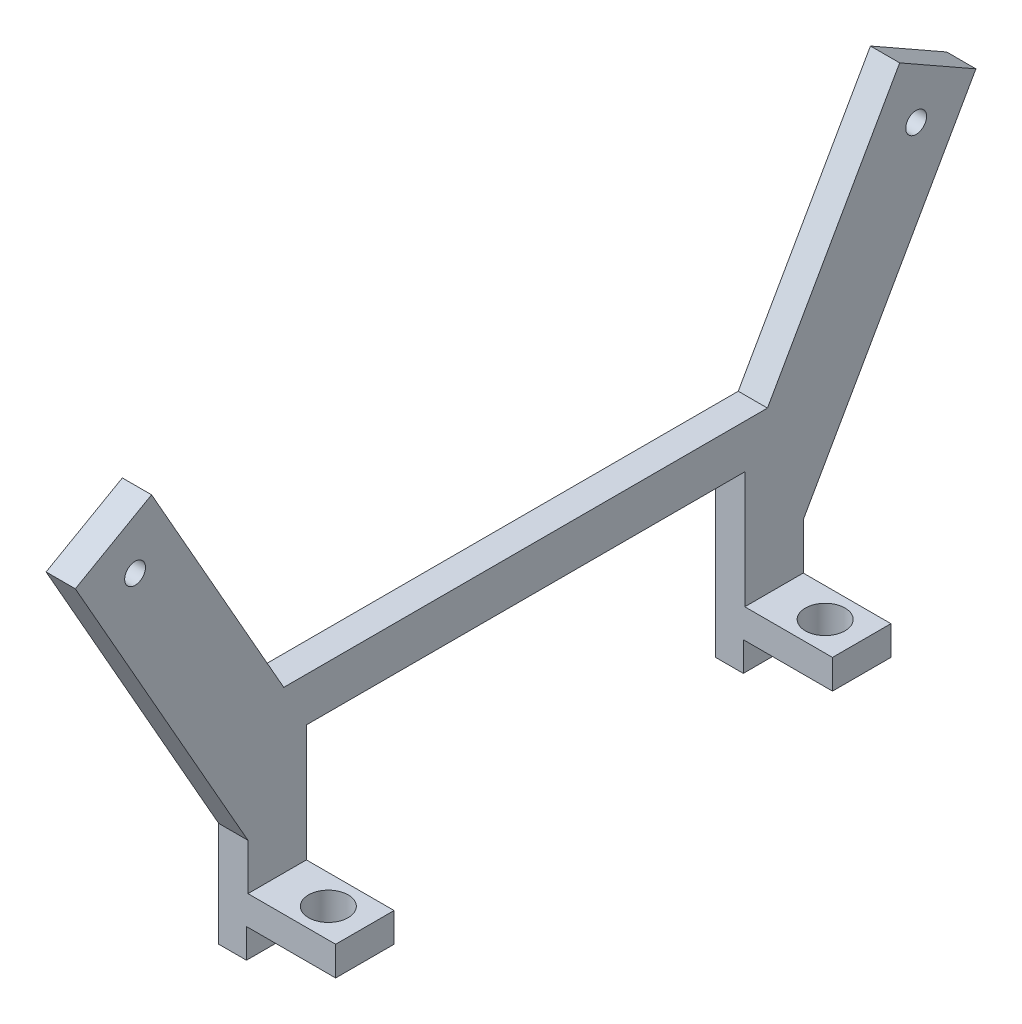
ISO-10303-21;
HEADER;
FILE_DESCRIPTION(('STEP AP214'),'2;1');
FILE_NAME('part.step','',(''),(''),'','','');
FILE_SCHEMA(('AUTOMOTIVE_DESIGN { 1 0 10303 214 1 1 1 1 }'));
ENDSEC;
DATA;
#1=APPLICATION_CONTEXT('core data for automotive mechanical design processes');
#2=APPLICATION_PROTOCOL_DEFINITION('international standard','automotive_design',2000,#1);
#3=PRODUCT_CONTEXT('',#1,'mechanical');
#4=PRODUCT('Part','Part','',(#3));
#5=PRODUCT_RELATED_PRODUCT_CATEGORY('part','',(#4));
#6=PRODUCT_DEFINITION_FORMATION('','',#4);
#7=PRODUCT_DEFINITION_CONTEXT('part definition',#1,'design');
#8=PRODUCT_DEFINITION('design','',#6,#7);
#9=PRODUCT_DEFINITION_SHAPE('','',#8);
#10=(LENGTH_UNIT() NAMED_UNIT(*) SI_UNIT(.MILLI.,.METRE.));
#11=(NAMED_UNIT(*) PLANE_ANGLE_UNIT() SI_UNIT($,.RADIAN.));
#12=(NAMED_UNIT(*) SI_UNIT($,.STERADIAN.) SOLID_ANGLE_UNIT());
#13=UNCERTAINTY_MEASURE_WITH_UNIT(LENGTH_MEASURE(1.E-05),#10,'distance_accuracy_value','');
#14=(GEOMETRIC_REPRESENTATION_CONTEXT(3) GLOBAL_UNCERTAINTY_ASSIGNED_CONTEXT((#13)) GLOBAL_UNIT_ASSIGNED_CONTEXT((#10,
#11,#12)) REPRESENTATION_CONTEXT('',''));
#15=CARTESIAN_POINT('',(0.,0.,0.));
#16=DIRECTION('',(0.,0.,1.));
#17=DIRECTION('',(1.,0.,0.));
#18=AXIS2_PLACEMENT_3D('',#15,#16,#17);
#19=CARTESIAN_POINT('',(-26.825,-40.6359035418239,48.9192421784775));
#20=DIRECTION('',(1.,0.,0.));
#21=DIRECTION('',(0.,1.,0.));
#22=AXIS2_PLACEMENT_3D('',#19,#20,#21);
#23=PLANE('',#22);
#24=CARTESIAN_POINT('',(-26.825,-42.4264068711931,-42.4264068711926));
#25=DIRECTION('',(1.,0.,0.));
#26=DIRECTION('',(0.,0.,-1.));
#27=AXIS2_PLACEMENT_3D('',#24,#25,#26);
#28=CIRCLE('',#27,1.13029999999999);
#29=CARTESIAN_POINT('',(-26.825,-42.4264068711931,-43.5567068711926));
#30=VERTEX_POINT('',#29);
#31=EDGE_CURVE('E296',#30,#30,#28,.T.);
#32=ORIENTED_EDGE('',*,*,#31,.F.);
#33=EDGE_LOOP('',(#32));
#34=FACE_BOUND('',#33,.T.);
#35=CARTESIAN_POINT('',(-26.825,-42.4264068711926,42.4264068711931));
#36=DIRECTION('',(1.,0.,0.));
#37=DIRECTION('',(0.,0.,-1.));
#38=AXIS2_PLACEMENT_3D('',#35,#36,#37);
#39=CIRCLE('',#38,1.13029999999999);
#40=CARTESIAN_POINT('',(-26.825,-42.4264068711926,41.2961068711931));
#41=VERTEX_POINT('',#40);
#42=EDGE_CURVE('E302',#41,#41,#39,.T.);
#43=ORIENTED_EDGE('',*,*,#42,.F.);
#44=EDGE_LOOP('',(#43));
#45=FACE_BOUND('',#44,.T.);
#46=DIRECTION('',(0.,-1.,0.));
#47=VECTOR('',#46,1.);
#48=CARTESIAN_POINT('',(-26.825,-81.869574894,-23.8125));
#49=LINE('',#48,#47);
#50=CARTESIAN_POINT('',(-26.825,-65.994574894,-23.8125));
#51=VERTEX_POINT('',#50);
#52=CARTESIAN_POINT('',(-26.825,-78.694574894,-23.8125));
#53=VERTEX_POINT('',#52);
#54=EDGE_CURVE('E197',#51,#53,#49,.T.);
#55=ORIENTED_EDGE('',*,*,#54,.T.);
#56=DIRECTION('',(0.,0.,1.));
#57=VECTOR('',#56,1.);
#58=CARTESIAN_POINT('',(-26.825,-78.694574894,-23.8125));
#59=LINE('',#58,#57);
#60=CARTESIAN_POINT('',(-26.825,-78.694574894,-30.1625));
#61=VERTEX_POINT('',#60);
#62=EDGE_CURVE('E183',#61,#53,#59,.T.);
#63=ORIENTED_EDGE('',*,*,#62,.F.);
#64=DIRECTION('',(0.,1.,0.));
#65=VECTOR('',#64,1.);
#66=CARTESIAN_POINT('',(-26.825,-73.6766262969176,-30.1625));
#67=LINE('',#66,#65);
#68=CARTESIAN_POINT('',(-26.825,-73.6766262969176,-30.1625));
#69=VERTEX_POINT('',#68);
#70=EDGE_CURVE('E204',#61,#69,#67,.T.);
#71=ORIENTED_EDGE('',*,*,#70,.T.);
#72=DIRECTION('',(0.,0.869641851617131,-0.49368314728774));
#73=VECTOR('',#72,1.);
#74=CARTESIAN_POINT('',(-26.825,-40.6359035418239,-48.9192421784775));
#75=LINE('',#74,#73);
#76=CARTESIAN_POINT('',(-26.825,-40.6359035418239,-48.9192421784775));
#77=VERTEX_POINT('',#76);
#78=EDGE_CURVE('E206',#69,#77,#75,.T.);
#79=ORIENTED_EDGE('',*,*,#78,.T.);
#80=DIRECTION('',(0.,0.49368314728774,0.869641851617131));
#81=VECTOR('',#80,1.);
#82=CARTESIAN_POINT('',(-26.825,-40.6359035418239,-48.9192421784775));
#83=LINE('',#82,#81);
#84=CARTESIAN_POINT('',(-26.825,-35.9335715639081,-40.6359035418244));
#85=VERTEX_POINT('',#84);
#86=EDGE_CURVE('E213',#77,#85,#83,.T.);
#87=ORIENTED_EDGE('',*,*,#86,.T.);
#88=DIRECTION('',(0.,-0.86964185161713,0.49368314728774));
#89=VECTOR('',#88,1.);
#90=CARTESIAN_POINT('',(-26.825,-35.9335715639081,-40.6359035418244));
#91=LINE('',#90,#89);
#92=CARTESIAN_POINT('',(-26.825,-61.232074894,-26.2743077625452));
#93=VERTEX_POINT('',#92);
#94=EDGE_CURVE('E215',#85,#93,#91,.T.);
#95=ORIENTED_EDGE('',*,*,#94,.T.);
#96=DIRECTION('',(0.,0.,1.));
#97=VECTOR('',#96,1.);
#98=CARTESIAN_POINT('',(-26.825,-61.232074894,26.2743077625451));
#99=LINE('',#98,#97);
#100=CARTESIAN_POINT('',(-26.825,-61.232074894,26.2743077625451));
#101=VERTEX_POINT('',#100);
#102=EDGE_CURVE('E217',#93,#101,#99,.T.);
#103=ORIENTED_EDGE('',*,*,#102,.T.);
#104=DIRECTION('',(0.,0.86964185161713,0.49368314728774));
#105=VECTOR('',#104,1.);
#106=CARTESIAN_POINT('',(-26.825,-35.9335715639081,40.6359035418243));
#107=LINE('',#106,#105);
#108=CARTESIAN_POINT('',(-26.825,-35.9335715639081,40.6359035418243));
#109=VERTEX_POINT('',#108);
#110=EDGE_CURVE('E219',#101,#109,#107,.T.);
#111=ORIENTED_EDGE('',*,*,#110,.T.);
#112=DIRECTION('',(0.,-0.493683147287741,0.86964185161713));
#113=VECTOR('',#112,1.);
#114=CARTESIAN_POINT('',(-26.825,-40.6359035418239,48.9192421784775));
#115=LINE('',#114,#113);
#116=CARTESIAN_POINT('',(-26.825,-40.6359035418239,48.9192421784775));
#117=VERTEX_POINT('',#116);
#118=EDGE_CURVE('E221',#109,#117,#115,.T.);
#119=ORIENTED_EDGE('',*,*,#118,.T.);
#120=DIRECTION('',(0.,-0.86964185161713,-0.49368314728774));
#121=VECTOR('',#120,1.);
#122=CARTESIAN_POINT('',(-26.825,-40.6359035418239,48.9192421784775));
#123=LINE('',#122,#121);
#124=CARTESIAN_POINT('',(-26.825,-73.6766262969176,30.1625));
#125=VERTEX_POINT('',#124);
#126=EDGE_CURVE('E261',#117,#125,#123,.T.);
#127=ORIENTED_EDGE('',*,*,#126,.T.);
#128=DIRECTION('',(0.,-1.,0.));
#129=VECTOR('',#128,1.);
#130=CARTESIAN_POINT('',(-26.825,-73.6766262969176,30.1625));
#131=LINE('',#130,#129);
#132=CARTESIAN_POINT('',(-26.825,-78.694574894,30.1625));
#133=VERTEX_POINT('',#132);
#134=EDGE_CURVE('E258',#125,#133,#131,.T.);
#135=ORIENTED_EDGE('',*,*,#134,.T.);
#136=DIRECTION('',(0.,0.,1.));
#137=VECTOR('',#136,1.);
#138=CARTESIAN_POINT('',(-26.825,-78.694574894,30.1625));
#139=LINE('',#138,#137);
#140=CARTESIAN_POINT('',(-26.825,-78.694574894,23.8125));
#141=VERTEX_POINT('',#140);
#142=EDGE_CURVE('E58',#141,#133,#139,.T.);
#143=ORIENTED_EDGE('',*,*,#142,.F.);
#144=DIRECTION('',(0.,1.,0.));
#145=VECTOR('',#144,1.);
#146=CARTESIAN_POINT('',(-26.825,-81.869574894,23.8125));
#147=LINE('',#146,#145);
#148=CARTESIAN_POINT('',(-26.825,-65.994574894,23.8125));
#149=VERTEX_POINT('',#148);
#150=EDGE_CURVE('E208',#141,#149,#147,.T.);
#151=ORIENTED_EDGE('',*,*,#150,.T.);
#152=DIRECTION('',(0.,0.,-1.));
#153=VECTOR('',#152,1.);
#154=CARTESIAN_POINT('',(-26.825,-65.994574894,23.8125));
#155=LINE('',#154,#153);
#156=EDGE_CURVE('E202',#149,#51,#155,.T.);
#157=ORIENTED_EDGE('',*,*,#156,.T.);
#158=EDGE_LOOP('',(#55,#63,#71,#79,#87,#95,#103,#111,#119,#127,#135,#143,#151,#157));
#159=FACE_BOUND('',#158,.T.);
#160=ADVANCED_FACE('F33',(#34,#45,#159),#23,.T.);
#161=CARTESIAN_POINT('',(-26.825,-81.869574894,-30.1625));
#162=DIRECTION('',(0.,1.,0.));
#163=DIRECTION('',(0.,0.,1.));
#164=AXIS2_PLACEMENT_3D('',#161,#162,#163);
#165=PLANE('',#164);
#166=CARTESIAN_POINT('',(-21.26875,-81.869574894,-26.9875));
#167=DIRECTION('',(0.,1.,0.));
#168=DIRECTION('',(0.,0.,1.));
#169=AXIS2_PLACEMENT_3D('',#166,#167,#168);
#170=CIRCLE('',#169,2.15265);
#171=CARTESIAN_POINT('',(-21.26875,-81.869574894,-24.83485));
#172=VERTEX_POINT('',#171);
#173=EDGE_CURVE('E191',#172,#172,#170,.T.);
#174=ORIENTED_EDGE('',*,*,#173,.T.);
#175=EDGE_LOOP('',(#174));
#176=FACE_BOUND('',#175,.T.);
#177=DIRECTION('',(0.,0.,1.));
#178=VECTOR('',#177,1.);
#179=CARTESIAN_POINT('',(-26.9875000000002,-81.869574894,-23.8125));
#180=LINE('',#179,#178);
#181=CARTESIAN_POINT('',(-26.9875000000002,-81.869574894,-30.1625));
#182=VERTEX_POINT('',#181);
#183=CARTESIAN_POINT('',(-26.9875000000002,-81.869574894,-23.8125));
#184=VERTEX_POINT('',#183);
#185=EDGE_CURVE('E340',#182,#184,#180,.T.);
#186=ORIENTED_EDGE('',*,*,#185,.F.);
#187=DIRECTION('',(-1.,0.,0.));
#188=VECTOR('',#187,1.);
#189=CARTESIAN_POINT('',(-26.825,-81.869574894,-30.1625));
#190=LINE('',#189,#188);
#191=CARTESIAN_POINT('',(-17.3,-81.869574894,-30.1625));
#192=VERTEX_POINT('',#191);
#193=EDGE_CURVE('E244',#192,#182,#190,.T.);
#194=ORIENTED_EDGE('',*,*,#193,.F.);
#195=DIRECTION('',(0.,0.,-1.));
#196=VECTOR('',#195,1.);
#197=CARTESIAN_POINT('',(-17.3,-81.869574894,-23.8125));
#198=LINE('',#197,#196);
#199=CARTESIAN_POINT('',(-17.3,-81.869574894,-23.8125));
#200=VERTEX_POINT('',#199);
#201=EDGE_CURVE('E399',#200,#192,#198,.T.);
#202=ORIENTED_EDGE('',*,*,#201,.F.);
#203=DIRECTION('',(-1.,0.,0.));
#204=VECTOR('',#203,1.);
#205=CARTESIAN_POINT('',(-26.825,-81.869574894,-23.8125));
#206=LINE('',#205,#204);
#207=EDGE_CURVE('E247',#200,#184,#206,.T.);
#208=ORIENTED_EDGE('',*,*,#207,.T.);
#209=EDGE_LOOP('',(#186,#194,#202,#208));
#210=FACE_BOUND('',#209,.T.);
#211=ADVANCED_FACE('F392',(#176,#210),#165,.F.);
#212=CARTESIAN_POINT('',(-26.825,-81.869574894,30.1625));
#213=DIRECTION('',(0.,1.,0.));
#214=DIRECTION('',(-1.,0.,0.));
#215=AXIS2_PLACEMENT_3D('',#212,#213,#214);
#216=PLANE('',#215);
#217=CARTESIAN_POINT('',(-21.26875,-81.869574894,26.9875));
#218=DIRECTION('',(0.,1.,0.));
#219=DIRECTION('',(-1.,0.,0.));
#220=AXIS2_PLACEMENT_3D('',#217,#218,#219);
#221=CIRCLE('',#220,2.15265);
#222=CARTESIAN_POINT('',(-23.4214,-81.869574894,26.9875));
#223=VERTEX_POINT('',#222);
#224=EDGE_CURVE('E410',#223,#223,#221,.T.);
#225=ORIENTED_EDGE('',*,*,#224,.T.);
#226=EDGE_LOOP('',(#225));
#227=FACE_BOUND('',#226,.T.);
#228=DIRECTION('',(0.,0.,1.));
#229=VECTOR('',#228,1.);
#230=CARTESIAN_POINT('',(-26.9875000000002,-81.869574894,30.1625));
#231=LINE('',#230,#229);
#232=CARTESIAN_POINT('',(-26.9875000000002,-81.869574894,23.8125));
#233=VERTEX_POINT('',#232);
#234=CARTESIAN_POINT('',(-26.9875000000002,-81.869574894,30.1625));
#235=VERTEX_POINT('',#234);
#236=EDGE_CURVE('E321',#233,#235,#231,.T.);
#237=ORIENTED_EDGE('',*,*,#236,.F.);
#238=DIRECTION('',(-1.,0.,0.));
#239=VECTOR('',#238,1.);
#240=CARTESIAN_POINT('',(-26.825,-81.869574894,23.8125));
#241=LINE('',#240,#239);
#242=CARTESIAN_POINT('',(-17.3,-81.869574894,23.8125));
#243=VERTEX_POINT('',#242);
#244=EDGE_CURVE('E254',#243,#233,#241,.T.);
#245=ORIENTED_EDGE('',*,*,#244,.F.);
#246=DIRECTION('',(0.,0.,-1.));
#247=VECTOR('',#246,1.);
#248=CARTESIAN_POINT('',(-17.3,-81.869574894,30.1625));
#249=LINE('',#248,#247);
#250=CARTESIAN_POINT('',(-17.3,-81.869574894,30.1625));
#251=VERTEX_POINT('',#250);
#252=EDGE_CURVE('E349',#251,#243,#249,.T.);
#253=ORIENTED_EDGE('',*,*,#252,.F.);
#254=DIRECTION('',(-1.,0.,0.));
#255=VECTOR('',#254,1.);
#256=CARTESIAN_POINT('',(-26.825,-81.869574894,30.1625));
#257=LINE('',#256,#255);
#258=EDGE_CURVE('E42',#251,#235,#257,.T.);
#259=ORIENTED_EDGE('',*,*,#258,.T.);
#260=EDGE_LOOP('',(#237,#245,#253,#259));
#261=FACE_BOUND('',#260,.T.);
#262=ADVANCED_FACE('F436',(#227,#261),#216,.F.);
#263=CARTESIAN_POINT('',(-26.825,-40.6359035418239,48.9192421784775));
#264=DIRECTION('',(0.,0.49368314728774,-0.86964185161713));
#265=DIRECTION('',(0.,0.869641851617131,0.49368314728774));
#266=AXIS2_PLACEMENT_3D('',#263,#264,#265);
#267=PLANE('',#266);
#268=DIRECTION('',(0.,-0.86964185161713,-0.49368314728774));
#269=VECTOR('',#268,1.);
#270=CARTESIAN_POINT('',(-30.,-40.6359035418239,48.9192421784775));
#271=LINE('',#270,#269);
#272=CARTESIAN_POINT('',(-30.,-40.6359035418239,48.9192421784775));
#273=VERTEX_POINT('',#272);
#274=CARTESIAN_POINT('',(-30.,-73.6766262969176,30.1625));
#275=VERTEX_POINT('',#274);
#276=EDGE_CURVE('E290',#273,#275,#271,.T.);
#277=ORIENTED_EDGE('',*,*,#276,.T.);
#278=DIRECTION('',(-1.,0.,0.));
#279=VECTOR('',#278,1.);
#280=CARTESIAN_POINT('',(-26.825,-73.6766262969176,30.1625));
#281=LINE('',#280,#279);
#282=EDGE_CURVE('E11',#125,#275,#281,.T.);
#283=ORIENTED_EDGE('',*,*,#282,.F.);
#284=ORIENTED_EDGE('',*,*,#126,.F.);
#285=DIRECTION('',(-1.,0.,0.));
#286=VECTOR('',#285,1.);
#287=CARTESIAN_POINT('',(-26.825,-40.6359035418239,48.9192421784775));
#288=LINE('',#287,#286);
#289=EDGE_CURVE('E223',#117,#273,#288,.T.);
#290=ORIENTED_EDGE('',*,*,#289,.T.);
#291=EDGE_LOOP('',(#277,#283,#284,#290));
#292=FACE_BOUND('',#291,.T.);
#293=ADVANCED_FACE('F35',(#292),#267,.F.);
#294=CARTESIAN_POINT('',(-26.825,-73.6766262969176,30.1625));
#295=DIRECTION('',(0.,0.,-1.));
#296=DIRECTION('',(0.,1.,0.));
#297=AXIS2_PLACEMENT_3D('',#294,#295,#296);
#298=PLANE('',#297);
#299=DIRECTION('',(0.,-1.,0.));
#300=VECTOR('',#299,1.);
#301=CARTESIAN_POINT('',(-30.,-73.6766262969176,30.1625));
#302=LINE('',#301,#300);
#303=CARTESIAN_POINT('',(-30.,-85.044574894,30.1625));
#304=VERTEX_POINT('',#303);
#305=EDGE_CURVE('E288',#275,#304,#302,.T.);
#306=ORIENTED_EDGE('',*,*,#305,.T.);
#307=DIRECTION('',(-1.,0.,0.));
#308=VECTOR('',#307,1.);
#309=CARTESIAN_POINT('',(-30.,-85.044574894,30.1625));
#310=LINE('',#309,#308);
#311=CARTESIAN_POINT('',(-26.9875000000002,-85.044574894,30.1625));
#312=VERTEX_POINT('',#311);
#313=EDGE_CURVE('E311',#312,#304,#310,.T.);
#314=ORIENTED_EDGE('',*,*,#313,.F.);
#315=DIRECTION('',(0.,1.,0.));
#316=VECTOR('',#315,1.);
#317=CARTESIAN_POINT('',(-26.9875000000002,-85.044574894,30.1625));
#318=LINE('',#317,#316);
#319=EDGE_CURVE('E308',#312,#235,#318,.T.);
#320=ORIENTED_EDGE('',*,*,#319,.T.);
#321=ORIENTED_EDGE('',*,*,#258,.F.);
#322=DIRECTION('',(0.,-1.,0.));
#323=VECTOR('',#322,1.);
#324=CARTESIAN_POINT('',(-17.3,-81.869574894,30.1625));
#325=LINE('',#324,#323);
#326=CARTESIAN_POINT('',(-17.3,-78.694574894,30.1625));
#327=VERTEX_POINT('',#326);
#328=EDGE_CURVE('E352',#327,#251,#325,.T.);
#329=ORIENTED_EDGE('',*,*,#328,.F.);
#330=DIRECTION('',(-1.,0.,0.));
#331=VECTOR('',#330,1.);
#332=CARTESIAN_POINT('',(-17.3,-78.694574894,30.1625));
#333=LINE('',#332,#331);
#334=EDGE_CURVE('E346',#327,#133,#333,.T.);
#335=ORIENTED_EDGE('',*,*,#334,.T.);
#336=ORIENTED_EDGE('',*,*,#134,.F.);
#337=ORIENTED_EDGE('',*,*,#282,.T.);
#338=EDGE_LOOP('',(#306,#314,#320,#321,#329,#335,#336,#337));
#339=FACE_BOUND('',#338,.T.);
#340=ADVANCED_FACE('F476',(#339),#298,.F.);
#341=CARTESIAN_POINT('',(-26.825,-81.869574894,23.8125));
#342=DIRECTION('',(0.,0.,1.));
#343=DIRECTION('',(0.,-1.,0.));
#344=AXIS2_PLACEMENT_3D('',#341,#342,#343);
#345=PLANE('',#344);
#346=DIRECTION('',(0.,1.,0.));
#347=VECTOR('',#346,1.);
#348=CARTESIAN_POINT('',(-30.,-81.869574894,23.8125));
#349=LINE('',#348,#347);
#350=CARTESIAN_POINT('',(-30.,-85.044574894,23.8125));
#351=VERTEX_POINT('',#350);
#352=CARTESIAN_POINT('',(-30.,-65.994574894,23.8125));
#353=VERTEX_POINT('',#352);
#354=EDGE_CURVE('E286',#351,#353,#349,.T.);
#355=ORIENTED_EDGE('',*,*,#354,.T.);
#356=DIRECTION('',(-1.,0.,0.));
#357=VECTOR('',#356,1.);
#358=CARTESIAN_POINT('',(-26.825,-65.994574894,23.8125));
#359=LINE('',#358,#357);
#360=EDGE_CURVE('E251',#149,#353,#359,.T.);
#361=ORIENTED_EDGE('',*,*,#360,.F.);
#362=ORIENTED_EDGE('',*,*,#150,.F.);
#363=DIRECTION('',(-1.,0.,0.));
#364=VECTOR('',#363,1.);
#365=CARTESIAN_POINT('',(-17.3,-78.694574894,23.8125));
#366=LINE('',#365,#364);
#367=CARTESIAN_POINT('',(-17.3,-78.694574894,23.8125));
#368=VERTEX_POINT('',#367);
#369=EDGE_CURVE('E343',#368,#141,#366,.T.);
#370=ORIENTED_EDGE('',*,*,#369,.F.);
#371=DIRECTION('',(0.,1.,0.));
#372=VECTOR('',#371,1.);
#373=CARTESIAN_POINT('',(-17.3,-81.869574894,23.8125));
#374=LINE('',#373,#372);
#375=EDGE_CURVE('E347',#243,#368,#374,.T.);
#376=ORIENTED_EDGE('',*,*,#375,.F.);
#377=ORIENTED_EDGE('',*,*,#244,.T.);
#378=DIRECTION('',(0.,1.,0.));
#379=VECTOR('',#378,1.);
#380=CARTESIAN_POINT('',(-26.9875000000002,-85.044574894,23.8125));
#381=LINE('',#380,#379);
#382=CARTESIAN_POINT('',(-26.9875000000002,-85.044574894,23.8125));
#383=VERTEX_POINT('',#382);
#384=EDGE_CURVE('E305',#383,#233,#381,.T.);
#385=ORIENTED_EDGE('',*,*,#384,.F.);
#386=DIRECTION('',(1.,0.,0.));
#387=VECTOR('',#386,1.);
#388=CARTESIAN_POINT('',(-30.,-85.044574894,23.8125));
#389=LINE('',#388,#387);
#390=EDGE_CURVE('E316',#351,#383,#389,.T.);
#391=ORIENTED_EDGE('',*,*,#390,.F.);
#392=EDGE_LOOP('',(#355,#361,#362,#370,#376,#377,#385,#391));
#393=FACE_BOUND('',#392,.T.);
#394=ADVANCED_FACE('F369',(#393),#345,.F.);
#395=CARTESIAN_POINT('',(-26.825,-65.994574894,23.8125));
#396=DIRECTION('',(0.,1.,0.));
#397=DIRECTION('',(-1.,0.,0.));
#398=AXIS2_PLACEMENT_3D('',#395,#396,#397);
#399=PLANE('',#398);
#400=DIRECTION('',(0.,0.,-1.));
#401=VECTOR('',#400,1.);
#402=CARTESIAN_POINT('',(-30.,-65.994574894,23.8125));
#403=LINE('',#402,#401);
#404=CARTESIAN_POINT('',(-30.,-65.994574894,-23.8125));
#405=VERTEX_POINT('',#404);
#406=EDGE_CURVE('E284',#353,#405,#403,.T.);
#407=ORIENTED_EDGE('',*,*,#406,.T.);
#408=DIRECTION('',(-1.,0.,0.));
#409=VECTOR('',#408,1.);
#410=CARTESIAN_POINT('',(-26.825,-65.994574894,-23.8125));
#411=LINE('',#410,#409);
#412=EDGE_CURVE('E249',#51,#405,#411,.T.);
#413=ORIENTED_EDGE('',*,*,#412,.F.);
#414=ORIENTED_EDGE('',*,*,#156,.F.);
#415=ORIENTED_EDGE('',*,*,#360,.T.);
#416=EDGE_LOOP('',(#407,#413,#414,#415));
#417=FACE_BOUND('',#416,.T.);
#418=ADVANCED_FACE('F374',(#417),#399,.F.);
#419=CARTESIAN_POINT('',(-26.825,-81.869574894,-23.8125));
#420=DIRECTION('',(0.,0.,-1.));
#421=DIRECTION('',(0.,1.,0.));
#422=AXIS2_PLACEMENT_3D('',#419,#420,#421);
#423=PLANE('',#422);
#424=DIRECTION('',(0.,-1.,0.));
#425=VECTOR('',#424,1.);
#426=CARTESIAN_POINT('',(-30.,-81.869574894,-23.8125));
#427=LINE('',#426,#425);
#428=CARTESIAN_POINT('',(-30.,-85.044574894,-23.8125));
#429=VERTEX_POINT('',#428);
#430=EDGE_CURVE('E282',#405,#429,#427,.T.);
#431=ORIENTED_EDGE('',*,*,#430,.T.);
#432=DIRECTION('',(-1.,0.,0.));
#433=VECTOR('',#432,1.);
#434=CARTESIAN_POINT('',(-30.,-85.044574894,-23.8125));
#435=LINE('',#434,#433);
#436=CARTESIAN_POINT('',(-26.9875000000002,-85.044574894,-23.8125));
#437=VERTEX_POINT('',#436);
#438=EDGE_CURVE('E330',#437,#429,#435,.T.);
#439=ORIENTED_EDGE('',*,*,#438,.F.);
#440=DIRECTION('',(0.,1.,0.));
#441=VECTOR('',#440,1.);
#442=CARTESIAN_POINT('',(-26.9875000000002,-85.044574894,-23.8125));
#443=LINE('',#442,#441);
#444=EDGE_CURVE('E327',#437,#184,#443,.T.);
#445=ORIENTED_EDGE('',*,*,#444,.T.);
#446=ORIENTED_EDGE('',*,*,#207,.F.);
#447=DIRECTION('',(0.,-1.,0.));
#448=VECTOR('',#447,1.);
#449=CARTESIAN_POINT('',(-17.3,-81.869574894,-23.8125));
#450=LINE('',#449,#448);
#451=CARTESIAN_POINT('',(-17.3,-78.694574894,-23.8125));
#452=VERTEX_POINT('',#451);
#453=EDGE_CURVE('E190',#452,#200,#450,.T.);
#454=ORIENTED_EDGE('',*,*,#453,.F.);
#455=DIRECTION('',(-1.,0.,0.));
#456=VECTOR('',#455,1.);
#457=CARTESIAN_POINT('',(-17.3,-78.694574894,-23.8125));
#458=LINE('',#457,#456);
#459=EDGE_CURVE('E186',#452,#53,#458,.T.);
#460=ORIENTED_EDGE('',*,*,#459,.T.);
#461=ORIENTED_EDGE('',*,*,#54,.F.);
#462=ORIENTED_EDGE('',*,*,#412,.T.);
#463=EDGE_LOOP('',(#431,#439,#445,#446,#454,#460,#461,#462));
#464=FACE_BOUND('',#463,.T.);
#465=ADVANCED_FACE('F195',(#464),#423,.F.);
#466=CARTESIAN_POINT('',(-26.825,-73.6766262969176,-30.1625));
#467=DIRECTION('',(0.,0.,1.));
#468=DIRECTION('',(0.,-1.,0.));
#469=AXIS2_PLACEMENT_3D('',#466,#467,#468);
#470=PLANE('',#469);
#471=DIRECTION('',(0.,1.,0.));
#472=VECTOR('',#471,1.);
#473=CARTESIAN_POINT('',(-30.,-73.6766262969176,-30.1625));
#474=LINE('',#473,#472);
#475=CARTESIAN_POINT('',(-30.,-85.044574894,-30.1625));
#476=VERTEX_POINT('',#475);
#477=CARTESIAN_POINT('',(-30.,-73.6766262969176,-30.1625));
#478=VERTEX_POINT('',#477);
#479=EDGE_CURVE('E280',#476,#478,#474,.T.);
#480=ORIENTED_EDGE('',*,*,#479,.T.);
#481=DIRECTION('',(-1.,0.,0.));
#482=VECTOR('',#481,1.);
#483=CARTESIAN_POINT('',(-26.825,-73.6766262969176,-30.1625));
#484=LINE('',#483,#482);
#485=EDGE_CURVE('E241',#69,#478,#484,.T.);
#486=ORIENTED_EDGE('',*,*,#485,.F.);
#487=ORIENTED_EDGE('',*,*,#70,.F.);
#488=DIRECTION('',(-1.,0.,0.));
#489=VECTOR('',#488,1.);
#490=CARTESIAN_POINT('',(-17.3,-78.694574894,-30.1625));
#491=LINE('',#490,#489);
#492=CARTESIAN_POINT('',(-17.3,-78.694574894,-30.1625));
#493=VERTEX_POINT('',#492);
#494=EDGE_CURVE('E50',#493,#61,#491,.T.);
#495=ORIENTED_EDGE('',*,*,#494,.F.);
#496=DIRECTION('',(0.,1.,0.));
#497=VECTOR('',#496,1.);
#498=CARTESIAN_POINT('',(-17.3,-81.869574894,-30.1625));
#499=LINE('',#498,#497);
#500=EDGE_CURVE('E397',#192,#493,#499,.T.);
#501=ORIENTED_EDGE('',*,*,#500,.F.);
#502=ORIENTED_EDGE('',*,*,#193,.T.);
#503=DIRECTION('',(0.,1.,0.));
#504=VECTOR('',#503,1.);
#505=CARTESIAN_POINT('',(-26.9875000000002,-85.044574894,-30.1625));
#506=LINE('',#505,#504);
#507=CARTESIAN_POINT('',(-26.9875000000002,-85.044574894,-30.1625));
#508=VERTEX_POINT('',#507);
#509=EDGE_CURVE('E324',#508,#182,#506,.T.);
#510=ORIENTED_EDGE('',*,*,#509,.F.);
#511=DIRECTION('',(1.,0.,0.));
#512=VECTOR('',#511,1.);
#513=CARTESIAN_POINT('',(-30.,-85.044574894,-30.1625));
#514=LINE('',#513,#512);
#515=EDGE_CURVE('E335',#476,#508,#514,.T.);
#516=ORIENTED_EDGE('',*,*,#515,.F.);
#517=EDGE_LOOP('',(#480,#486,#487,#495,#501,#502,#510,#516));
#518=FACE_BOUND('',#517,.T.);
#519=ADVANCED_FACE('F396',(#518),#470,.F.);
#520=CARTESIAN_POINT('',(-26.825,-40.6359035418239,-48.9192421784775));
#521=DIRECTION('',(0.,0.49368314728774,0.86964185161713));
#522=DIRECTION('',(0.,-0.869641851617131,0.49368314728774));
#523=AXIS2_PLACEMENT_3D('',#520,#521,#522);
#524=PLANE('',#523);
#525=DIRECTION('',(0.,0.869641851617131,-0.49368314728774));
#526=VECTOR('',#525,1.);
#527=CARTESIAN_POINT('',(-30.,-40.6359035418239,-48.9192421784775));
#528=LINE('',#527,#526);
#529=CARTESIAN_POINT('',(-30.,-40.6359035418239,-48.9192421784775));
#530=VERTEX_POINT('',#529);
#531=EDGE_CURVE('E278',#478,#530,#528,.T.);
#532=ORIENTED_EDGE('',*,*,#531,.T.);
#533=DIRECTION('',(-1.,0.,0.));
#534=VECTOR('',#533,1.);
#535=CARTESIAN_POINT('',(-26.825,-40.6359035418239,-48.9192421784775));
#536=LINE('',#535,#534);
#537=EDGE_CURVE('E238',#77,#530,#536,.T.);
#538=ORIENTED_EDGE('',*,*,#537,.F.);
#539=ORIENTED_EDGE('',*,*,#78,.F.);
#540=ORIENTED_EDGE('',*,*,#485,.T.);
#541=EDGE_LOOP('',(#532,#538,#539,#540));
#542=FACE_BOUND('',#541,.T.);
#543=ADVANCED_FACE('F463',(#542),#524,.F.);
#544=CARTESIAN_POINT('',(-26.825,-40.6359035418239,-48.9192421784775));
#545=DIRECTION('',(0.,-0.869641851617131,0.49368314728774));
#546=DIRECTION('',(0.,-0.49368314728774,-0.869641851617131));
#547=AXIS2_PLACEMENT_3D('',#544,#545,#546);
#548=PLANE('',#547);
#549=DIRECTION('',(0.,0.49368314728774,0.869641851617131));
#550=VECTOR('',#549,1.);
#551=CARTESIAN_POINT('',(-30.,-40.6359035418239,-48.9192421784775));
#552=LINE('',#551,#550);
#553=CARTESIAN_POINT('',(-30.,-35.9335715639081,-40.6359035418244));
#554=VERTEX_POINT('',#553);
#555=EDGE_CURVE('E276',#530,#554,#552,.T.);
#556=ORIENTED_EDGE('',*,*,#555,.T.);
#557=DIRECTION('',(-1.,0.,0.));
#558=VECTOR('',#557,1.);
#559=CARTESIAN_POINT('',(-26.825,-35.9335715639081,-40.6359035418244));
#560=LINE('',#559,#558);
#561=EDGE_CURVE('E235',#85,#554,#560,.T.);
#562=ORIENTED_EDGE('',*,*,#561,.F.);
#563=ORIENTED_EDGE('',*,*,#86,.F.);
#564=ORIENTED_EDGE('',*,*,#537,.T.);
#565=EDGE_LOOP('',(#556,#562,#563,#564));
#566=FACE_BOUND('',#565,.T.);
#567=ADVANCED_FACE('F459',(#566),#548,.F.);
#568=CARTESIAN_POINT('',(-26.825,-35.9335715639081,-40.6359035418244));
#569=DIRECTION('',(0.,-0.493683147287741,-0.869641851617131));
#570=DIRECTION('',(0.,0.86964185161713,-0.493683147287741));
#571=AXIS2_PLACEMENT_3D('',#568,#569,#570);
#572=PLANE('',#571);
#573=DIRECTION('',(0.,-0.86964185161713,0.49368314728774));
#574=VECTOR('',#573,1.);
#575=CARTESIAN_POINT('',(-30.,-35.9335715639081,-40.6359035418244));
#576=LINE('',#575,#574);
#577=CARTESIAN_POINT('',(-30.,-61.232074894,-26.2743077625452));
#578=VERTEX_POINT('',#577);
#579=EDGE_CURVE('E274',#554,#578,#576,.T.);
#580=ORIENTED_EDGE('',*,*,#579,.T.);
#581=DIRECTION('',(-1.,0.,0.));
#582=VECTOR('',#581,1.);
#583=CARTESIAN_POINT('',(-26.825,-61.232074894,-26.2743077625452));
#584=LINE('',#583,#582);
#585=EDGE_CURVE('E232',#93,#578,#584,.T.);
#586=ORIENTED_EDGE('',*,*,#585,.F.);
#587=ORIENTED_EDGE('',*,*,#94,.F.);
#588=ORIENTED_EDGE('',*,*,#561,.T.);
#589=EDGE_LOOP('',(#580,#586,#587,#588));
#590=FACE_BOUND('',#589,.T.);
#591=ADVANCED_FACE('F455',(#590),#572,.F.);
#592=CARTESIAN_POINT('',(-26.825,-61.232074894,26.2743077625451));
#593=DIRECTION('',(0.,-1.,0.));
#594=DIRECTION('',(0.,0.,-1.));
#595=AXIS2_PLACEMENT_3D('',#592,#593,#594);
#596=PLANE('',#595);
#597=DIRECTION('',(0.,0.,1.));
#598=VECTOR('',#597,1.);
#599=CARTESIAN_POINT('',(-30.,-61.232074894,26.2743077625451));
#600=LINE('',#599,#598);
#601=CARTESIAN_POINT('',(-30.,-61.232074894,26.2743077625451));
#602=VERTEX_POINT('',#601);
#603=EDGE_CURVE('E272',#578,#602,#600,.T.);
#604=ORIENTED_EDGE('',*,*,#603,.T.);
#605=DIRECTION('',(-1.,0.,0.));
#606=VECTOR('',#605,1.);
#607=CARTESIAN_POINT('',(-26.825,-61.232074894,26.2743077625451));
#608=LINE('',#607,#606);
#609=EDGE_CURVE('E229',#101,#602,#608,.T.);
#610=ORIENTED_EDGE('',*,*,#609,.F.);
#611=ORIENTED_EDGE('',*,*,#102,.F.);
#612=ORIENTED_EDGE('',*,*,#585,.T.);
#613=EDGE_LOOP('',(#604,#610,#611,#612));
#614=FACE_BOUND('',#613,.T.);
#615=ADVANCED_FACE('F451',(#614),#596,.F.);
#616=CARTESIAN_POINT('',(-26.825,-35.9335715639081,40.6359035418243));
#617=DIRECTION('',(0.,-0.493683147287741,0.869641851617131));
#618=DIRECTION('',(0.,-0.86964185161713,-0.493683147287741));
#619=AXIS2_PLACEMENT_3D('',#616,#617,#618);
#620=PLANE('',#619);
#621=DIRECTION('',(0.,0.86964185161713,0.49368314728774));
#622=VECTOR('',#621,1.);
#623=CARTESIAN_POINT('',(-30.,-35.9335715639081,40.6359035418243));
#624=LINE('',#623,#622);
#625=CARTESIAN_POINT('',(-30.,-35.9335715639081,40.6359035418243));
#626=VERTEX_POINT('',#625);
#627=EDGE_CURVE('E270',#602,#626,#624,.T.);
#628=ORIENTED_EDGE('',*,*,#627,.T.);
#629=DIRECTION('',(-1.,0.,0.));
#630=VECTOR('',#629,1.);
#631=CARTESIAN_POINT('',(-26.825,-35.9335715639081,40.6359035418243));
#632=LINE('',#631,#630);
#633=EDGE_CURVE('E226',#109,#626,#632,.T.);
#634=ORIENTED_EDGE('',*,*,#633,.F.);
#635=ORIENTED_EDGE('',*,*,#110,.F.);
#636=ORIENTED_EDGE('',*,*,#609,.T.);
#637=EDGE_LOOP('',(#628,#634,#635,#636));
#638=FACE_BOUND('',#637,.T.);
#639=ADVANCED_FACE('F447',(#638),#620,.F.);
#640=CARTESIAN_POINT('',(-26.825,-40.6359035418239,48.9192421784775));
#641=DIRECTION('',(0.,-0.86964185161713,-0.493683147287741));
#642=DIRECTION('',(0.,0.493683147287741,-0.86964185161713));
#643=AXIS2_PLACEMENT_3D('',#640,#641,#642);
#644=PLANE('',#643);
#645=DIRECTION('',(0.,-0.493683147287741,0.86964185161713));
#646=VECTOR('',#645,1.);
#647=CARTESIAN_POINT('',(-30.,-40.6359035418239,48.9192421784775));
#648=LINE('',#647,#646);
#649=EDGE_CURVE('E268',#626,#273,#648,.T.);
#650=ORIENTED_EDGE('',*,*,#649,.T.);
#651=ORIENTED_EDGE('',*,*,#289,.F.);
#652=ORIENTED_EDGE('',*,*,#118,.F.);
#653=ORIENTED_EDGE('',*,*,#633,.T.);
#654=EDGE_LOOP('',(#650,#651,#652,#653));
#655=FACE_BOUND('',#654,.T.);
#656=ADVANCED_FACE('F444',(#655),#644,.F.);
#657=CARTESIAN_POINT('',(-30.,-40.6359035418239,48.9192421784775));
#658=DIRECTION('',(1.,0.,0.));
#659=DIRECTION('',(0.,1.,0.));
#660=AXIS2_PLACEMENT_3D('',#657,#658,#659);
#661=PLANE('',#660);
#662=CARTESIAN_POINT('',(-30.,-42.4264068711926,42.4264068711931));
#663=DIRECTION('',(1.,0.,0.));
#664=DIRECTION('',(0.,0.,-1.));
#665=AXIS2_PLACEMENT_3D('',#662,#663,#664);
#666=CIRCLE('',#665,1.1303);
#667=CARTESIAN_POINT('',(-30.,-42.4264068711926,41.2961068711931));
#668=VERTEX_POINT('',#667);
#669=EDGE_CURVE('E299',#668,#668,#666,.T.);
#670=ORIENTED_EDGE('',*,*,#669,.T.);
#671=EDGE_LOOP('',(#670));
#672=FACE_BOUND('',#671,.T.);
#673=CARTESIAN_POINT('',(-30.,-42.4264068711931,-42.4264068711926));
#674=DIRECTION('',(1.,0.,0.));
#675=DIRECTION('',(0.,0.,-1.));
#676=AXIS2_PLACEMENT_3D('',#673,#674,#675);
#677=CIRCLE('',#676,1.1303);
#678=CARTESIAN_POINT('',(-30.,-42.4264068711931,-43.5567068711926));
#679=VERTEX_POINT('',#678);
#680=EDGE_CURVE('E293',#679,#679,#677,.T.);
#681=ORIENTED_EDGE('',*,*,#680,.T.);
#682=EDGE_LOOP('',(#681));
#683=FACE_BOUND('',#682,.T.);
#684=ORIENTED_EDGE('',*,*,#276,.F.);
#685=ORIENTED_EDGE('',*,*,#649,.F.);
#686=ORIENTED_EDGE('',*,*,#627,.F.);
#687=ORIENTED_EDGE('',*,*,#603,.F.);
#688=ORIENTED_EDGE('',*,*,#579,.F.);
#689=ORIENTED_EDGE('',*,*,#555,.F.);
#690=ORIENTED_EDGE('',*,*,#531,.F.);
#691=ORIENTED_EDGE('',*,*,#479,.F.);
#692=DIRECTION('',(0.,0.,-1.));
#693=VECTOR('',#692,1.);
#694=CARTESIAN_POINT('',(-30.,-85.044574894,-23.8125));
#695=LINE('',#694,#693);
#696=EDGE_CURVE('E337',#429,#476,#695,.T.);
#697=ORIENTED_EDGE('',*,*,#696,.F.);
#698=ORIENTED_EDGE('',*,*,#430,.F.);
#699=ORIENTED_EDGE('',*,*,#406,.F.);
#700=ORIENTED_EDGE('',*,*,#354,.F.);
#701=DIRECTION('',(0.,0.,-1.));
#702=VECTOR('',#701,1.);
#703=CARTESIAN_POINT('',(-30.,-85.044574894,30.1625));
#704=LINE('',#703,#702);
#705=EDGE_CURVE('E318',#304,#351,#704,.T.);
#706=ORIENTED_EDGE('',*,*,#705,.F.);
#707=ORIENTED_EDGE('',*,*,#305,.F.);
#708=EDGE_LOOP('',(#684,#685,#686,#687,#688,#689,#690,#691,#697,#698,#699,#700,#706,#707));
#709=FACE_BOUND('',#708,.T.);
#710=ADVANCED_FACE('F380',(#672,#683,#709),#661,.F.);
#711=CARTESIAN_POINT('',(-26.825,-42.4264068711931,-42.4264068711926));
#712=DIRECTION('',(1.,0.,0.));
#713=DIRECTION('',(0.,0.,-1.));
#714=AXIS2_PLACEMENT_3D('',#711,#712,#713);
#715=CYLINDRICAL_SURFACE('',#714,1.13029999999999);
#716=ORIENTED_EDGE('',*,*,#680,.F.);
#717=EDGE_LOOP('',(#716));
#718=FACE_BOUND('',#717,.T.);
#719=ORIENTED_EDGE('',*,*,#31,.T.);
#720=EDGE_LOOP('',(#719));
#721=FACE_BOUND('',#720,.T.);
#722=ADVANCED_FACE('F525',(#718,#721),#715,.F.);
#723=CARTESIAN_POINT('',(-26.825,-42.4264068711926,42.4264068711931));
#724=DIRECTION('',(1.,0.,0.));
#725=DIRECTION('',(0.,0.,-1.));
#726=AXIS2_PLACEMENT_3D('',#723,#724,#725);
#727=CYLINDRICAL_SURFACE('',#726,1.13029999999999);
#728=ORIENTED_EDGE('',*,*,#669,.F.);
#729=EDGE_LOOP('',(#728));
#730=FACE_BOUND('',#729,.T.);
#731=ORIENTED_EDGE('',*,*,#42,.T.);
#732=EDGE_LOOP('',(#731));
#733=FACE_BOUND('',#732,.T.);
#734=ADVANCED_FACE('F518',(#730,#733),#727,.F.);
#735=CARTESIAN_POINT('',(-26.9875000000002,-85.044574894,30.1625));
#736=DIRECTION('',(-1.,0.,0.));
#737=DIRECTION('',(0.,0.,1.));
#738=AXIS2_PLACEMENT_3D('',#735,#736,#737);
#739=PLANE('',#738);
#740=ORIENTED_EDGE('',*,*,#236,.T.);
#741=ORIENTED_EDGE('',*,*,#319,.F.);
#742=DIRECTION('',(0.,0.,1.));
#743=VECTOR('',#742,1.);
#744=CARTESIAN_POINT('',(-26.9875000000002,-85.044574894,30.1625));
#745=LINE('',#744,#743);
#746=EDGE_CURVE('E314',#383,#312,#745,.T.);
#747=ORIENTED_EDGE('',*,*,#746,.F.);
#748=ORIENTED_EDGE('',*,*,#384,.T.);
#749=EDGE_LOOP('',(#740,#741,#747,#748));
#750=FACE_BOUND('',#749,.T.);
#751=ADVANCED_FACE('F494',(#750),#739,.F.);
#752=CARTESIAN_POINT('',(-30.,-85.044574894,23.8125));
#753=DIRECTION('',(0.,-1.,0.));
#754=DIRECTION('',(0.,0.,-1.));
#755=AXIS2_PLACEMENT_3D('',#752,#753,#754);
#756=PLANE('',#755);
#757=ORIENTED_EDGE('',*,*,#705,.T.);
#758=ORIENTED_EDGE('',*,*,#390,.T.);
#759=ORIENTED_EDGE('',*,*,#746,.T.);
#760=ORIENTED_EDGE('',*,*,#313,.T.);
#761=EDGE_LOOP('',(#757,#758,#759,#760));
#762=FACE_BOUND('',#761,.T.);
#763=ADVANCED_FACE('F489',(#762),#756,.T.);
#764=CARTESIAN_POINT('',(-26.9875000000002,-85.044574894,-23.8125));
#765=DIRECTION('',(-1.,0.,0.));
#766=DIRECTION('',(0.,-1.,0.));
#767=AXIS2_PLACEMENT_3D('',#764,#765,#766);
#768=PLANE('',#767);
#769=ORIENTED_EDGE('',*,*,#185,.T.);
#770=ORIENTED_EDGE('',*,*,#444,.F.);
#771=DIRECTION('',(0.,0.,1.));
#772=VECTOR('',#771,1.);
#773=CARTESIAN_POINT('',(-26.9875000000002,-85.044574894,-23.8125));
#774=LINE('',#773,#772);
#775=EDGE_CURVE('E333',#508,#437,#774,.T.);
#776=ORIENTED_EDGE('',*,*,#775,.F.);
#777=ORIENTED_EDGE('',*,*,#509,.T.);
#778=EDGE_LOOP('',(#769,#770,#776,#777));
#779=FACE_BOUND('',#778,.T.);
#780=ADVANCED_FACE('F390',(#779),#768,.F.);
#781=CARTESIAN_POINT('',(-30.,-85.044574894,-30.1625));
#782=DIRECTION('',(0.,-1.,0.));
#783=DIRECTION('',(0.,0.,-1.));
#784=AXIS2_PLACEMENT_3D('',#781,#782,#783);
#785=PLANE('',#784);
#786=ORIENTED_EDGE('',*,*,#696,.T.);
#787=ORIENTED_EDGE('',*,*,#515,.T.);
#788=ORIENTED_EDGE('',*,*,#775,.T.);
#789=ORIENTED_EDGE('',*,*,#438,.T.);
#790=EDGE_LOOP('',(#786,#787,#788,#789));
#791=FACE_BOUND('',#790,.T.);
#792=ADVANCED_FACE('F384',(#791),#785,.T.);
#793=CARTESIAN_POINT('',(-17.3,-78.694574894,30.1625));
#794=DIRECTION('',(0.,-1.,0.));
#795=DIRECTION('',(1.,0.,0.));
#796=AXIS2_PLACEMENT_3D('',#793,#794,#795);
#797=PLANE('',#796);
#798=CARTESIAN_POINT('',(-21.26875,-78.6945748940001,26.9875));
#799=DIRECTION('',(0.,1.,0.));
#800=DIRECTION('',(0.,0.,1.));
#801=AXIS2_PLACEMENT_3D('',#798,#799,#800);
#802=CIRCLE('',#801,2.15265);
#803=CARTESIAN_POINT('',(-21.26875,-78.6945748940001,29.14015));
#804=VERTEX_POINT('',#803);
#805=EDGE_CURVE('E413',#804,#804,#802,.T.);
#806=ORIENTED_EDGE('',*,*,#805,.F.);
#807=EDGE_LOOP('',(#806));
#808=FACE_BOUND('',#807,.T.);
#809=ORIENTED_EDGE('',*,*,#142,.T.);
#810=ORIENTED_EDGE('',*,*,#334,.F.);
#811=DIRECTION('',(0.,0.,1.));
#812=VECTOR('',#811,1.);
#813=CARTESIAN_POINT('',(-17.3,-78.694574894,30.1625));
#814=LINE('',#813,#812);
#815=EDGE_CURVE('E344',#368,#327,#814,.T.);
#816=ORIENTED_EDGE('',*,*,#815,.F.);
#817=ORIENTED_EDGE('',*,*,#369,.T.);
#818=EDGE_LOOP('',(#809,#810,#816,#817));
#819=FACE_BOUND('',#818,.T.);
#820=ADVANCED_FACE('F365',(#808,#819),#797,.F.);
#821=CARTESIAN_POINT('',(-17.3,-78.694574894,30.1625));
#822=DIRECTION('',(-1.,0.,0.));
#823=DIRECTION('',(0.,0.,1.));
#824=AXIS2_PLACEMENT_3D('',#821,#822,#823);
#825=PLANE('',#824);
#826=ORIENTED_EDGE('',*,*,#328,.T.);
#827=ORIENTED_EDGE('',*,*,#252,.T.);
#828=ORIENTED_EDGE('',*,*,#375,.T.);
#829=ORIENTED_EDGE('',*,*,#815,.T.);
#830=EDGE_LOOP('',(#826,#827,#828,#829));
#831=FACE_BOUND('',#830,.T.);
#832=ADVANCED_FACE('F421',(#831),#825,.F.);
#833=CARTESIAN_POINT('',(-17.3,-78.694574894,-23.8125));
#834=DIRECTION('',(0.,-1.,0.));
#835=DIRECTION('',(1.,0.,0.));
#836=AXIS2_PLACEMENT_3D('',#833,#834,#835);
#837=PLANE('',#836);
#838=CARTESIAN_POINT('',(-21.26875,-78.6945748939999,-26.9875));
#839=DIRECTION('',(0.,1.,0.));
#840=DIRECTION('',(0.,0.,1.));
#841=AXIS2_PLACEMENT_3D('',#838,#839,#840);
#842=CIRCLE('',#841,2.15265);
#843=CARTESIAN_POINT('',(-21.26875,-78.6945748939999,-24.83485));
#844=VERTEX_POINT('',#843);
#845=EDGE_CURVE('E407',#844,#844,#842,.T.);
#846=ORIENTED_EDGE('',*,*,#845,.F.);
#847=EDGE_LOOP('',(#846));
#848=FACE_BOUND('',#847,.T.);
#849=ORIENTED_EDGE('',*,*,#62,.T.);
#850=ORIENTED_EDGE('',*,*,#459,.F.);
#851=DIRECTION('',(0.,0.,1.));
#852=VECTOR('',#851,1.);
#853=CARTESIAN_POINT('',(-17.3,-78.694574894,-23.8125));
#854=LINE('',#853,#852);
#855=EDGE_CURVE('E199',#493,#452,#854,.T.);
#856=ORIENTED_EDGE('',*,*,#855,.F.);
#857=ORIENTED_EDGE('',*,*,#494,.T.);
#858=EDGE_LOOP('',(#849,#850,#856,#857));
#859=FACE_BOUND('',#858,.T.);
#860=ADVANCED_FACE('F185',(#848,#859),#837,.F.);
#861=CARTESIAN_POINT('',(-17.3,-78.694574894,-23.8125));
#862=DIRECTION('',(-1.,0.,0.));
#863=DIRECTION('',(0.,0.,1.));
#864=AXIS2_PLACEMENT_3D('',#861,#862,#863);
#865=PLANE('',#864);
#866=ORIENTED_EDGE('',*,*,#453,.T.);
#867=ORIENTED_EDGE('',*,*,#201,.T.);
#868=ORIENTED_EDGE('',*,*,#500,.T.);
#869=ORIENTED_EDGE('',*,*,#855,.T.);
#870=EDGE_LOOP('',(#866,#867,#868,#869));
#871=FACE_BOUND('',#870,.T.);
#872=ADVANCED_FACE('F695',(#871),#865,.F.);
#873=CARTESIAN_POINT('',(-21.26875,-78.6945748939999,-26.9875));
#874=DIRECTION('',(0.,1.,0.));
#875=DIRECTION('',(0.,0.,1.));
#876=AXIS2_PLACEMENT_3D('',#873,#874,#875);
#877=CYLINDRICAL_SURFACE('',#876,2.15265);
#878=ORIENTED_EDGE('',*,*,#845,.T.);
#879=EDGE_LOOP('',(#878));
#880=FACE_BOUND('',#879,.T.);
#881=ORIENTED_EDGE('',*,*,#173,.F.);
#882=EDGE_LOOP('',(#881));
#883=FACE_BOUND('',#882,.T.);
#884=ADVANCED_FACE('F703',(#880,#883),#877,.F.);
#885=CARTESIAN_POINT('',(-21.26875,-78.6945748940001,26.9875));
#886=DIRECTION('',(0.,1.,0.));
#887=DIRECTION('',(0.,0.,1.));
#888=AXIS2_PLACEMENT_3D('',#885,#886,#887);
#889=CYLINDRICAL_SURFACE('',#888,2.15265);
#890=ORIENTED_EDGE('',*,*,#805,.T.);
#891=EDGE_LOOP('',(#890));
#892=FACE_BOUND('',#891,.T.);
#893=ORIENTED_EDGE('',*,*,#224,.F.);
#894=EDGE_LOOP('',(#893));
#895=FACE_BOUND('',#894,.T.);
#896=ADVANCED_FACE('F417',(#892,#895),#889,.F.);
#897=CLOSED_SHELL('',(#160,#211,#262,#293,#340,#394,#418,#465,#519,#543,#567,#591,#615,#639,
#656,#710,#722,#734,#751,#763,#780,#792,#820,#832,#860,#872,#884,#896));
#898=MANIFOLD_SOLID_BREP('B2',#897);
#899=ADVANCED_BREP_SHAPE_REPRESENTATION('',(#18,#898),#14);
#900=SHAPE_DEFINITION_REPRESENTATION(#9,#899);
ENDSEC;
END-ISO-10303-21;
